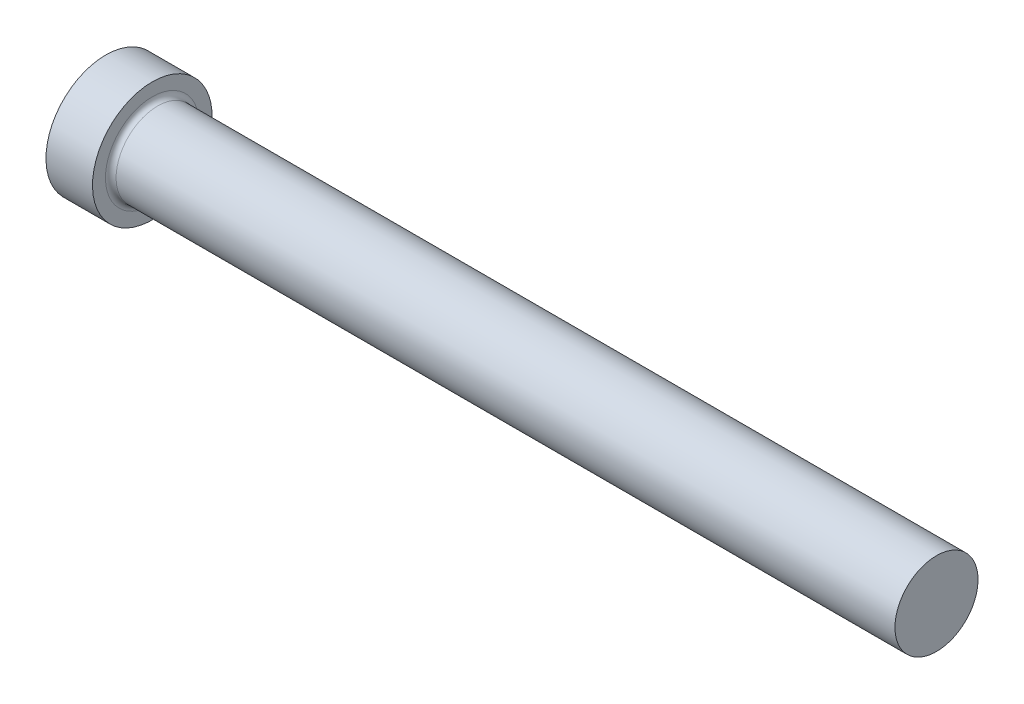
ISO-10303-21;
HEADER;
FILE_DESCRIPTION(('STEP AP214'),'2;1');
FILE_NAME('part.step','',(''),(''),'','','');
FILE_SCHEMA(('AUTOMOTIVE_DESIGN { 1 0 10303 214 1 1 1 1 }'));
ENDSEC;
DATA;
#1=APPLICATION_CONTEXT('core data for automotive mechanical design processes');
#2=APPLICATION_PROTOCOL_DEFINITION('international standard','automotive_design',2000,#1);
#3=PRODUCT_CONTEXT('',#1,'mechanical');
#4=PRODUCT('Part','Part','',(#3));
#5=PRODUCT_RELATED_PRODUCT_CATEGORY('part','',(#4));
#6=PRODUCT_DEFINITION_FORMATION('','',#4);
#7=PRODUCT_DEFINITION_CONTEXT('part definition',#1,'design');
#8=PRODUCT_DEFINITION('design','',#6,#7);
#9=PRODUCT_DEFINITION_SHAPE('','',#8);
#10=(LENGTH_UNIT() NAMED_UNIT(*) SI_UNIT(.MILLI.,.METRE.));
#11=(NAMED_UNIT(*) PLANE_ANGLE_UNIT() SI_UNIT($,.RADIAN.));
#12=(NAMED_UNIT(*) SI_UNIT($,.STERADIAN.) SOLID_ANGLE_UNIT());
#13=UNCERTAINTY_MEASURE_WITH_UNIT(LENGTH_MEASURE(1.E-05),#10,'distance_accuracy_value','');
#14=(GEOMETRIC_REPRESENTATION_CONTEXT(3) GLOBAL_UNCERTAINTY_ASSIGNED_CONTEXT((#13)) GLOBAL_UNIT_ASSIGNED_CONTEXT((#10,
#11,#12)) REPRESENTATION_CONTEXT('',''));
#15=CARTESIAN_POINT('',(0.,0.,0.));
#16=DIRECTION('',(0.,0.,1.));
#17=DIRECTION('',(1.,0.,0.));
#18=AXIS2_PLACEMENT_3D('',#15,#16,#17);
#19=CARTESIAN_POINT('',(0.,0.,0.));
#20=DIRECTION('',(-1.,0.,0.));
#21=DIRECTION('',(0.,-1.,0.));
#22=AXIS2_PLACEMENT_3D('',#19,#20,#21);
#23=PLANE('',#22);
#24=CARTESIAN_POINT('',(0.,0.,0.));
#25=DIRECTION('',(1.,0.,0.));
#26=DIRECTION('',(0.,1.,0.));
#27=AXIS2_PLACEMENT_3D('',#24,#25,#26);
#28=CIRCLE('',#27,9.);
#29=CARTESIAN_POINT('',(0.,9.,0.));
#30=VERTEX_POINT('',#29);
#31=EDGE_CURVE('E25',#30,#30,#28,.T.);
#32=ORIENTED_EDGE('',*,*,#31,.F.);
#33=EDGE_LOOP('',(#32));
#34=FACE_BOUND('',#33,.T.);
#35=ADVANCED_FACE('F14',(#34),#23,.T.);
#36=CARTESIAN_POINT('',(125.,0.,0.));
#37=DIRECTION('',(1.,0.,0.));
#38=DIRECTION('',(0.,1.,0.));
#39=AXIS2_PLACEMENT_3D('',#36,#37,#38);
#40=CYLINDRICAL_SURFACE('',#39,9.);
#41=ORIENTED_EDGE('',*,*,#31,.T.);
#42=EDGE_LOOP('',(#41));
#43=FACE_BOUND('',#42,.T.);
#44=CARTESIAN_POINT('',(7.,0.,0.));
#45=DIRECTION('',(1.,0.,0.));
#46=DIRECTION('',(0.,1.,0.));
#47=AXIS2_PLACEMENT_3D('',#44,#45,#46);
#48=CIRCLE('',#47,9.);
#49=CARTESIAN_POINT('',(7.,9.,0.));
#50=VERTEX_POINT('',#49);
#51=EDGE_CURVE('E29',#50,#50,#48,.T.);
#52=ORIENTED_EDGE('',*,*,#51,.F.);
#53=EDGE_LOOP('',(#52));
#54=FACE_BOUND('',#53,.T.);
#55=ADVANCED_FACE('F51',(#43,#54),#40,.T.);
#56=CARTESIAN_POINT('',(7.,9.,0.));
#57=DIRECTION('',(1.,0.,0.));
#58=DIRECTION('',(0.,1.,0.));
#59=AXIS2_PLACEMENT_3D('',#56,#57,#58);
#60=PLANE('',#59);
#61=CARTESIAN_POINT('',(7.,0.,0.));
#62=DIRECTION('',(1.,0.,0.));
#63=DIRECTION('',(0.,1.,0.));
#64=AXIS2_PLACEMENT_3D('',#61,#62,#63);
#65=CIRCLE('',#64,7.05);
#66=CARTESIAN_POINT('',(7.,7.05,0.));
#67=VERTEX_POINT('',#66);
#68=EDGE_CURVE('E9',#67,#67,#65,.F.);
#69=ORIENTED_EDGE('',*,*,#68,.T.);
#70=EDGE_LOOP('',(#69));
#71=FACE_BOUND('',#70,.T.);
#72=ORIENTED_EDGE('',*,*,#51,.T.);
#73=EDGE_LOOP('',(#72));
#74=FACE_BOUND('',#73,.T.);
#75=ADVANCED_FACE('F42',(#71,#74),#60,.T.);
#76=CARTESIAN_POINT('',(125.,0.,0.));
#77=DIRECTION('',(1.,0.,0.));
#78=DIRECTION('',(0.,1.,0.));
#79=AXIS2_PLACEMENT_3D('',#76,#77,#78);
#80=CYLINDRICAL_SURFACE('',#79,6.25);
#81=CARTESIAN_POINT('',(7.8,0.,0.));
#82=DIRECTION('',(1.,0.,0.));
#83=DIRECTION('',(0.,1.,0.));
#84=AXIS2_PLACEMENT_3D('',#81,#82,#83);
#85=CIRCLE('',#84,6.25);
#86=CARTESIAN_POINT('',(7.8,6.25,0.));
#87=VERTEX_POINT('',#86);
#88=EDGE_CURVE('E21',#87,#87,#85,.T.);
#89=ORIENTED_EDGE('',*,*,#88,.T.);
#90=EDGE_LOOP('',(#89));
#91=FACE_BOUND('',#90,.T.);
#92=CARTESIAN_POINT('',(125.,0.,0.));
#93=DIRECTION('',(1.,0.,0.));
#94=DIRECTION('',(0.,1.,0.));
#95=AXIS2_PLACEMENT_3D('',#92,#93,#94);
#96=CIRCLE('',#95,6.25);
#97=CARTESIAN_POINT('',(125.,6.25,0.));
#98=VERTEX_POINT('',#97);
#99=EDGE_CURVE('E34',#98,#98,#96,.T.);
#100=ORIENTED_EDGE('',*,*,#99,.F.);
#101=EDGE_LOOP('',(#100));
#102=FACE_BOUND('',#101,.T.);
#103=ADVANCED_FACE('F40',(#91,#102),#80,.T.);
#104=CARTESIAN_POINT('',(125.,6.25,0.));
#105=DIRECTION('',(1.,0.,0.));
#106=DIRECTION('',(0.,1.,0.));
#107=AXIS2_PLACEMENT_3D('',#104,#105,#106);
#108=PLANE('',#107);
#109=ORIENTED_EDGE('',*,*,#99,.T.);
#110=EDGE_LOOP('',(#109));
#111=FACE_BOUND('',#110,.T.);
#112=ADVANCED_FACE('F38',(#111),#108,.T.);
#113=CARTESIAN_POINT('',(7.8,0.,0.));
#114=DIRECTION('',(1.,0.,0.));
#115=DIRECTION('',(0.,1.,0.));
#116=AXIS2_PLACEMENT_3D('',#113,#114,#115);
#117=TOROIDAL_SURFACE('',#116,7.05,0.8);
#118=ORIENTED_EDGE('',*,*,#68,.F.);
#119=EDGE_LOOP('',(#118));
#120=FACE_BOUND('',#119,.T.);
#121=ORIENTED_EDGE('',*,*,#88,.F.);
#122=EDGE_LOOP('',(#121));
#123=FACE_BOUND('',#122,.T.);
#124=ADVANCED_FACE('F16',(#120,#123),#117,.F.);
#125=CLOSED_SHELL('',(#35,#55,#75,#103,#112,#124));
#126=MANIFOLD_SOLID_BREP('B1',#125);
#127=ADVANCED_BREP_SHAPE_REPRESENTATION('',(#18,#126),#14);
#128=SHAPE_DEFINITION_REPRESENTATION(#9,#127);
ENDSEC;
END-ISO-10303-21;
